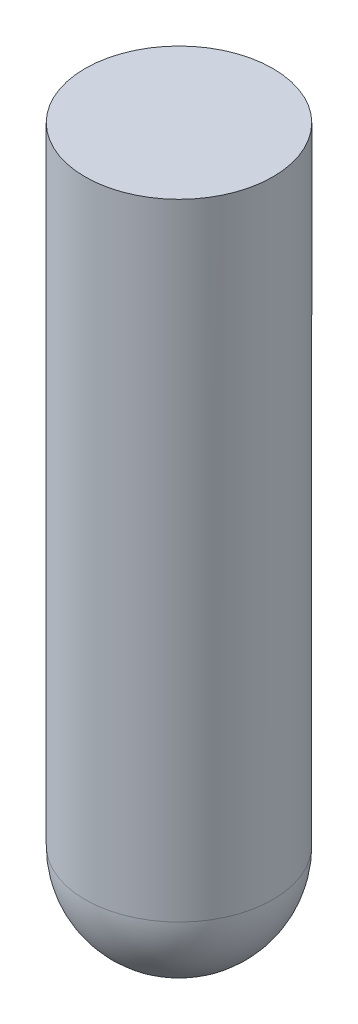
ISO-10303-21;
HEADER;
FILE_DESCRIPTION(('STEP AP214'),'2;1');
FILE_NAME('part.step','',(''),(''),'','','');
FILE_SCHEMA(('AUTOMOTIVE_DESIGN { 1 0 10303 214 1 1 1 1 }'));
ENDSEC;
DATA;
#1=APPLICATION_CONTEXT('core data for automotive mechanical design processes');
#2=APPLICATION_PROTOCOL_DEFINITION('international standard','automotive_design',2000,#1);
#3=PRODUCT_CONTEXT('',#1,'mechanical');
#4=PRODUCT('Part','Part','',(#3));
#5=PRODUCT_RELATED_PRODUCT_CATEGORY('part','',(#4));
#6=PRODUCT_DEFINITION_FORMATION('','',#4);
#7=PRODUCT_DEFINITION_CONTEXT('part definition',#1,'design');
#8=PRODUCT_DEFINITION('design','',#6,#7);
#9=PRODUCT_DEFINITION_SHAPE('','',#8);
#10=(LENGTH_UNIT() NAMED_UNIT(*) SI_UNIT(.MILLI.,.METRE.));
#11=(NAMED_UNIT(*) PLANE_ANGLE_UNIT() SI_UNIT($,.RADIAN.));
#12=(NAMED_UNIT(*) SI_UNIT($,.STERADIAN.) SOLID_ANGLE_UNIT());
#13=UNCERTAINTY_MEASURE_WITH_UNIT(LENGTH_MEASURE(1.E-05),#10,'distance_accuracy_value','');
#14=(GEOMETRIC_REPRESENTATION_CONTEXT(3) GLOBAL_UNCERTAINTY_ASSIGNED_CONTEXT((#13)) GLOBAL_UNIT_ASSIGNED_CONTEXT((#10,
#11,#12)) REPRESENTATION_CONTEXT('',''));
#15=CARTESIAN_POINT('',(0.,0.,0.));
#16=DIRECTION('',(0.,0.,1.));
#17=DIRECTION('',(1.,0.,0.));
#18=AXIS2_PLACEMENT_3D('',#15,#16,#17);
#19=CARTESIAN_POINT('',(74.625,167.6575,0.));
#20=DIRECTION('',(0.,1.,0.));
#21=DIRECTION('',(-1.,0.,0.));
#22=AXIS2_PLACEMENT_3D('',#19,#20,#21);
#23=CYLINDRICAL_SURFACE('',#22,1.4925);
#24=CARTESIAN_POINT('',(74.625,169.15,0.));
#25=DIRECTION('',(0.,1.,0.));
#26=DIRECTION('',(0.,0.,1.));
#27=AXIS2_PLACEMENT_3D('',#24,#25,#26);
#28=CIRCLE('',#27,1.4925);
#29=CARTESIAN_POINT('',(74.625,169.15,1.4925));
#30=VERTEX_POINT('',#29);
#31=EDGE_CURVE('E10',#30,#30,#28,.T.);
#32=ORIENTED_EDGE('',*,*,#31,.T.);
#33=EDGE_LOOP('',(#32));
#34=FACE_BOUND('',#33,.T.);
#35=CARTESIAN_POINT('',(74.625,179.1,0.));
#36=DIRECTION('',(0.,-1.,0.));
#37=DIRECTION('',(1.,0.,0.));
#38=AXIS2_PLACEMENT_3D('',#35,#36,#37);
#39=CIRCLE('',#38,1.4925);
#40=CARTESIAN_POINT('',(76.1175,179.1,0.));
#41=VERTEX_POINT('',#40);
#42=EDGE_CURVE('E21',#41,#41,#39,.T.);
#43=ORIENTED_EDGE('',*,*,#42,.T.);
#44=EDGE_LOOP('',(#43));
#45=FACE_BOUND('',#44,.T.);
#46=ADVANCED_FACE('F14',(#34,#45),#23,.T.);
#47=CARTESIAN_POINT('',(74.625,179.1,0.));
#48=DIRECTION('',(0.,-1.,0.));
#49=DIRECTION('',(1.,0.,0.));
#50=AXIS2_PLACEMENT_3D('',#47,#48,#49);
#51=PLANE('',#50);
#52=ORIENTED_EDGE('',*,*,#42,.F.);
#53=EDGE_LOOP('',(#52));
#54=FACE_BOUND('',#53,.T.);
#55=ADVANCED_FACE('F47',(#54),#51,.F.);
#56=CARTESIAN_POINT('',(74.625,169.15,0.));
#57=DIRECTION('',(0.,0.,1.));
#58=DIRECTION('',(1.,0.,0.));
#59=AXIS2_PLACEMENT_3D('',#56,#57,#58);
#60=SPHERICAL_SURFACE('',#59,1.4925);
#61=CARTESIAN_POINT('',(74.625,169.15,0.));
#62=DIRECTION('',(0.,1.,0.));
#63=DIRECTION('',(0.,0.,1.));
#64=AXIS2_PLACEMENT_3D('',#61,#62,#63);
#65=SPHERICAL_SURFACE('',#64,1.4925);
#66=ORIENTED_EDGE('',*,*,#31,.F.);
#67=EDGE_LOOP('',(#66));
#68=FACE_BOUND('',#67,.T.);
#69=ADVANCED_FACE('F49',(#68),#65,.T.);
#70=CLOSED_SHELL('',(#46,#55,#69));
#71=MANIFOLD_SOLID_BREP('B1',#70);
#72=ADVANCED_BREP_SHAPE_REPRESENTATION('',(#18,#71),#14);
#73=SHAPE_DEFINITION_REPRESENTATION(#9,#72);
ENDSEC;
END-ISO-10303-21;
